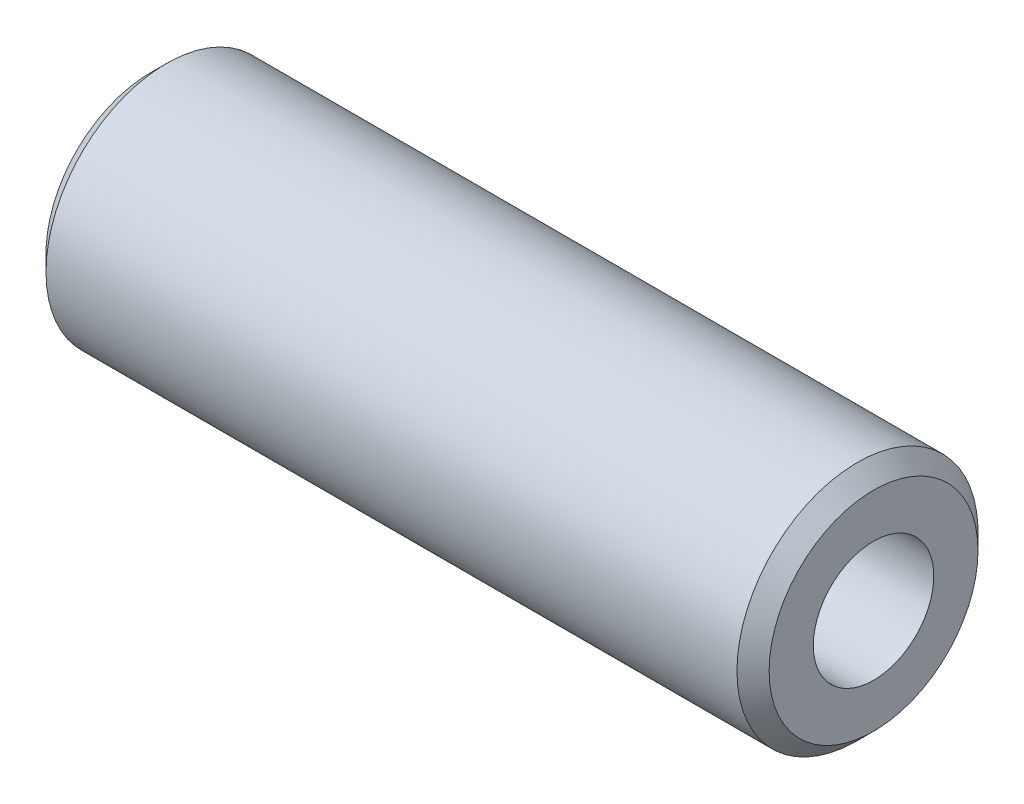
ISO-10303-21;
HEADER;
FILE_DESCRIPTION(('STEP AP214'),'2;1');
FILE_NAME('part.step','',(''),(''),'','','');
FILE_SCHEMA(('AUTOMOTIVE_DESIGN { 1 0 10303 214 1 1 1 1 }'));
ENDSEC;
DATA;
#1=APPLICATION_CONTEXT('core data for automotive mechanical design processes');
#2=APPLICATION_PROTOCOL_DEFINITION('international standard','automotive_design',2000,#1);
#3=PRODUCT_CONTEXT('',#1,'mechanical');
#4=PRODUCT('Part','Part','',(#3));
#5=PRODUCT_RELATED_PRODUCT_CATEGORY('part','',(#4));
#6=PRODUCT_DEFINITION_FORMATION('','',#4);
#7=PRODUCT_DEFINITION_CONTEXT('part definition',#1,'design');
#8=PRODUCT_DEFINITION('design','',#6,#7);
#9=PRODUCT_DEFINITION_SHAPE('','',#8);
#10=(LENGTH_UNIT() NAMED_UNIT(*) SI_UNIT(.MILLI.,.METRE.));
#11=(NAMED_UNIT(*) PLANE_ANGLE_UNIT() SI_UNIT($,.RADIAN.));
#12=(NAMED_UNIT(*) SI_UNIT($,.STERADIAN.) SOLID_ANGLE_UNIT());
#13=UNCERTAINTY_MEASURE_WITH_UNIT(LENGTH_MEASURE(1.E-05),#10,'distance_accuracy_value','');
#14=(GEOMETRIC_REPRESENTATION_CONTEXT(3) GLOBAL_UNCERTAINTY_ASSIGNED_CONTEXT((#13)) GLOBAL_UNIT_ASSIGNED_CONTEXT((#10,
#11,#12)) REPRESENTATION_CONTEXT('',''));
#15=CARTESIAN_POINT('',(0.,0.,0.));
#16=DIRECTION('',(0.,0.,1.));
#17=DIRECTION('',(1.,0.,0.));
#18=AXIS2_PLACEMENT_3D('',#15,#16,#17);
#19=CARTESIAN_POINT('',(45.,0.,0.));
#20=DIRECTION('',(1.,0.,0.));
#21=DIRECTION('',(0.,0.,-1.));
#22=AXIS2_PLACEMENT_3D('',#19,#20,#21);
#23=PLANE('',#22);
#24=CARTESIAN_POINT('',(45.,0.,0.));
#25=DIRECTION('',(1.,0.,0.));
#26=DIRECTION('',(0.,0.,-1.));
#27=AXIS2_PLACEMENT_3D('',#24,#25,#26);
#28=CIRCLE('',#27,13.0000000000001);
#29=CARTESIAN_POINT('',(45.,0.,-13.0000000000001));
#30=VERTEX_POINT('',#29);
#31=EDGE_CURVE('E10',#30,#30,#28,.T.);
#32=ORIENTED_EDGE('',*,*,#31,.T.);
#33=EDGE_LOOP('',(#32));
#34=FACE_BOUND('',#33,.T.);
#35=CARTESIAN_POINT('',(45.,0.,0.));
#36=DIRECTION('',(1.,0.,0.));
#37=DIRECTION('',(0.,0.,-1.));
#38=AXIS2_PLACEMENT_3D('',#35,#36,#37);
#39=CIRCLE('',#38,7.5);
#40=CARTESIAN_POINT('',(45.,0.,7.5));
#41=VERTEX_POINT('',#40);
#42=EDGE_CURVE('E59',#41,#41,#39,.T.);
#43=ORIENTED_EDGE('',*,*,#42,.F.);
#44=EDGE_LOOP('',(#43));
#45=FACE_BOUND('',#44,.T.);
#46=ADVANCED_FACE('F38',(#34,#45),#23,.T.);
#47=CARTESIAN_POINT('',(-45.,0.,0.));
#48=DIRECTION('',(1.,0.,0.));
#49=DIRECTION('',(0.,0.,-1.));
#50=AXIS2_PLACEMENT_3D('',#47,#48,#49);
#51=PLANE('',#50);
#52=CARTESIAN_POINT('',(-45.,0.,0.));
#53=DIRECTION('',(1.,0.,0.));
#54=DIRECTION('',(0.,0.,-1.));
#55=AXIS2_PLACEMENT_3D('',#52,#53,#54);
#56=CIRCLE('',#55,13.);
#57=CARTESIAN_POINT('',(-45.,0.,-13.));
#58=VERTEX_POINT('',#57);
#59=EDGE_CURVE('E46',#58,#58,#56,.F.);
#60=ORIENTED_EDGE('',*,*,#59,.T.);
#61=EDGE_LOOP('',(#60));
#62=FACE_BOUND('',#61,.T.);
#63=CARTESIAN_POINT('',(-45.,0.,0.));
#64=DIRECTION('',(1.,0.,0.));
#65=DIRECTION('',(0.,0.,-1.));
#66=AXIS2_PLACEMENT_3D('',#63,#64,#65);
#67=CIRCLE('',#66,7.5);
#68=CARTESIAN_POINT('',(-45.,0.,7.5));
#69=VERTEX_POINT('',#68);
#70=EDGE_CURVE('E60',#69,#69,#67,.T.);
#71=ORIENTED_EDGE('',*,*,#70,.T.);
#72=EDGE_LOOP('',(#71));
#73=FACE_BOUND('',#72,.T.);
#74=ADVANCED_FACE('F70',(#62,#73),#51,.F.);
#75=CARTESIAN_POINT('',(45.,0.,0.));
#76=DIRECTION('',(-1.,0.,0.));
#77=DIRECTION('',(0.,0.,1.));
#78=AXIS2_PLACEMENT_3D('',#75,#76,#77);
#79=CYLINDRICAL_SURFACE('',#78,15.);
#80=CARTESIAN_POINT('',(-43.,0.,0.));
#81=DIRECTION('',(1.,0.,0.));
#82=DIRECTION('',(0.,0.,-1.));
#83=AXIS2_PLACEMENT_3D('',#80,#81,#82);
#84=CIRCLE('',#83,15.);
#85=CARTESIAN_POINT('',(-43.,0.,15.));
#86=VERTEX_POINT('',#85);
#87=EDGE_CURVE('E50',#86,#86,#84,.T.);
#88=CARTESIAN_POINT('',(43.,0.,0.));
#89=DIRECTION('',(1.,0.,0.));
#90=DIRECTION('',(0.,0.,-1.));
#91=AXIS2_PLACEMENT_3D('',#88,#89,#90);
#92=CIRCLE('',#91,15.);
#93=CARTESIAN_POINT('',(43.,0.,15.));
#94=VERTEX_POINT('',#93);
#95=EDGE_CURVE('E54',#94,#94,#92,.F.);
#96=CARTESIAN_POINT('',(-43.,0.,15.));
#97=CARTESIAN_POINT('',(-42.1041666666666,0.,15.));
#98=CARTESIAN_POINT('',(-41.2083333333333,0.,15.));
#99=CARTESIAN_POINT('',(-39.4166666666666,0.,15.));
#100=CARTESIAN_POINT('',(-38.5208333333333,0.,15.));
#101=CARTESIAN_POINT('',(-36.7291666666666,0.,15.));
#102=CARTESIAN_POINT('',(-35.8333333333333,0.,15.));
#103=CARTESIAN_POINT('',(-34.0416666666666,0.,15.));
#104=CARTESIAN_POINT('',(-33.1458333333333,0.,15.));
#105=CARTESIAN_POINT('',(-31.3541666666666,0.,15.));
#106=CARTESIAN_POINT('',(-30.4583333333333,0.,15.));
#107=CARTESIAN_POINT('',(-28.6666666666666,0.,15.));
#108=CARTESIAN_POINT('',(-27.7708333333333,0.,15.));
#109=CARTESIAN_POINT('',(-25.9791666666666,0.,15.));
#110=CARTESIAN_POINT('',(-25.0833333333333,0.,15.));
#111=CARTESIAN_POINT('',(-23.2916666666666,0.,15.));
#112=CARTESIAN_POINT('',(-22.3958333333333,0.,15.));
#113=CARTESIAN_POINT('',(-20.6041666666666,0.,15.));
#114=CARTESIAN_POINT('',(-19.7083333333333,0.,15.));
#115=CARTESIAN_POINT('',(-17.9166666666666,0.,15.));
#116=CARTESIAN_POINT('',(-17.0208333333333,0.,15.));
#117=CARTESIAN_POINT('',(-15.2291666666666,0.,15.));
#118=CARTESIAN_POINT('',(-14.3333333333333,0.,15.));
#119=CARTESIAN_POINT('',(-12.5416666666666,0.,15.));
#120=CARTESIAN_POINT('',(-11.6458333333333,0.,15.));
#121=CARTESIAN_POINT('',(-9.85416666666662,0.,15.));
#122=CARTESIAN_POINT('',(-8.95833333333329,0.,15.));
#123=CARTESIAN_POINT('',(-7.16666666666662,0.,15.));
#124=CARTESIAN_POINT('',(-6.27083333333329,0.,15.));
#125=CARTESIAN_POINT('',(-4.47916666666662,0.,15.));
#126=CARTESIAN_POINT('',(-3.58333333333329,0.,15.));
#127=CARTESIAN_POINT('',(-1.79166666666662,0.,15.));
#128=CARTESIAN_POINT('',(-0.895833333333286,0.,15.));
#129=CARTESIAN_POINT('',(0.895833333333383,0.,15.));
#130=CARTESIAN_POINT('',(1.79166666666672,0.,15.));
#131=CARTESIAN_POINT('',(3.58333333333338,0.,15.));
#132=CARTESIAN_POINT('',(4.47916666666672,0.,15.));
#133=CARTESIAN_POINT('',(6.27083333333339,0.,15.));
#134=CARTESIAN_POINT('',(7.16666666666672,0.,15.));
#135=CARTESIAN_POINT('',(8.95833333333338,0.,15.));
#136=CARTESIAN_POINT('',(9.85416666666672,0.,15.));
#137=CARTESIAN_POINT('',(11.6458333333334,0.,15.));
#138=CARTESIAN_POINT('',(12.5416666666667,0.,15.));
#139=CARTESIAN_POINT('',(14.3333333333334,0.,15.));
#140=CARTESIAN_POINT('',(15.2291666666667,0.,15.));
#141=CARTESIAN_POINT('',(17.0208333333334,0.,15.));
#142=CARTESIAN_POINT('',(17.9166666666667,0.,15.));
#143=CARTESIAN_POINT('',(19.7083333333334,0.,15.));
#144=CARTESIAN_POINT('',(20.6041666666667,0.,15.));
#145=CARTESIAN_POINT('',(22.3958333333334,0.,15.));
#146=CARTESIAN_POINT('',(23.2916666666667,0.,15.));
#147=CARTESIAN_POINT('',(25.0833333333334,0.,15.));
#148=CARTESIAN_POINT('',(25.9791666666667,0.,15.));
#149=CARTESIAN_POINT('',(27.7708333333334,0.,15.));
#150=CARTESIAN_POINT('',(28.6666666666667,0.,15.));
#151=CARTESIAN_POINT('',(30.4583333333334,0.,15.));
#152=CARTESIAN_POINT('',(31.3541666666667,0.,15.));
#153=CARTESIAN_POINT('',(33.1458333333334,0.,15.));
#154=CARTESIAN_POINT('',(34.0416666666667,0.,15.));
#155=CARTESIAN_POINT('',(35.8333333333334,0.,15.));
#156=CARTESIAN_POINT('',(36.7291666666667,0.,15.));
#157=CARTESIAN_POINT('',(38.5208333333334,0.,15.));
#158=CARTESIAN_POINT('',(39.4166666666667,0.,15.));
#159=CARTESIAN_POINT('',(41.2083333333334,0.,15.));
#160=CARTESIAN_POINT('',(42.1041666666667,0.,15.));
#161=CARTESIAN_POINT('',(43.,0.,15.));
#162=B_SPLINE_CURVE_WITH_KNOTS('',3,(#96,#97,#98,#99,#100,#101,#102,#103,#104,#105,#106,#107,
#108,#109,#110,#111,#112,#113,#114,#115,#116,#117,#118,#119,#120,#121,#122,#123,#124,#125,#126,
#127,#128,#129,#130,#131,#132,#133,#134,#135,#136,#137,#138,#139,#140,#141,#142,#143,#144,#145,
#146,#147,#148,#149,#150,#151,#152,#153,#154,#155,#156,#157,#158,#159,#160,#161),.UNSPECIFIED.,
.F.,.F.,(4,2,2,2,2,2,2,2,2,2,2,2,2,2,2,2,2,2,2,2,2,2,2,2,2,2,2,2,2,2,2,2,4),(0.,2.6875,5.375,
8.0625,10.75,13.4375,16.125,18.8125,21.5,24.1875,26.875,29.5625,32.25,34.9375,37.625,40.3125,
43.,45.6875,48.375,51.0625,53.75,56.4375,59.125,61.8125,64.5,67.1875,69.875,72.5625,75.25,
77.9375,80.625,83.3125,86.),.UNSPECIFIED.);
#163=EDGE_CURVE('BSEAM75',#86,#94,#162,.T.);
#164=ORIENTED_EDGE('',*,*,#87,.T.);
#165=ORIENTED_EDGE('',*,*,#95,.T.);
#166=ORIENTED_EDGE('',*,*,#163,.T.);
#167=ORIENTED_EDGE('',*,*,#163,.F.);
#168=EDGE_LOOP('',(#164,#166,#165,#167));
#169=FACE_BOUND('',#168,.T.);
#170=ADVANCED_FACE('F75',(#169),#79,.T.);
#171=CARTESIAN_POINT('',(45.,0.,0.));
#172=DIRECTION('',(-1.,0.,0.));
#173=DIRECTION('',(0.,0.,1.));
#174=AXIS2_PLACEMENT_3D('',#171,#172,#173);
#175=CYLINDRICAL_SURFACE('',#174,7.5);
#176=CARTESIAN_POINT('',(45.,0.,7.5));
#177=CARTESIAN_POINT('',(44.0625,0.,7.5));
#178=CARTESIAN_POINT('',(43.125,0.,7.5));
#179=CARTESIAN_POINT('',(41.25,0.,7.5));
#180=CARTESIAN_POINT('',(40.3125,0.,7.5));
#181=CARTESIAN_POINT('',(38.4375,0.,7.5));
#182=CARTESIAN_POINT('',(37.5,0.,7.5));
#183=CARTESIAN_POINT('',(35.625,0.,7.5));
#184=CARTESIAN_POINT('',(34.6875,0.,7.5));
#185=CARTESIAN_POINT('',(32.8125,0.,7.5));
#186=CARTESIAN_POINT('',(31.875,0.,7.5));
#187=CARTESIAN_POINT('',(30.,0.,7.5));
#188=CARTESIAN_POINT('',(29.0625,0.,7.5));
#189=CARTESIAN_POINT('',(27.1875,0.,7.5));
#190=CARTESIAN_POINT('',(26.25,0.,7.5));
#191=CARTESIAN_POINT('',(24.375,0.,7.5));
#192=CARTESIAN_POINT('',(23.4375,0.,7.5));
#193=CARTESIAN_POINT('',(21.5625,0.,7.5));
#194=CARTESIAN_POINT('',(20.625,0.,7.5));
#195=CARTESIAN_POINT('',(18.75,0.,7.5));
#196=CARTESIAN_POINT('',(17.8125,0.,7.5));
#197=CARTESIAN_POINT('',(15.9375,0.,7.5));
#198=CARTESIAN_POINT('',(15.,0.,7.5));
#199=CARTESIAN_POINT('',(13.125,0.,7.5));
#200=CARTESIAN_POINT('',(12.1875,0.,7.5));
#201=CARTESIAN_POINT('',(10.3125,0.,7.5));
#202=CARTESIAN_POINT('',(9.37499999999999,0.,7.5));
#203=CARTESIAN_POINT('',(7.5,0.,7.5));
#204=CARTESIAN_POINT('',(6.5625,0.,7.5));
#205=CARTESIAN_POINT('',(4.6875,0.,7.5));
#206=CARTESIAN_POINT('',(3.75,0.,7.5));
#207=CARTESIAN_POINT('',(1.87499999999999,0.,7.5));
#208=CARTESIAN_POINT('',(0.937499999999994,0.,7.5));
#209=CARTESIAN_POINT('',(-0.937500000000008,0.,7.5));
#210=CARTESIAN_POINT('',(-1.87500000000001,0.,7.5));
#211=CARTESIAN_POINT('',(-3.75000000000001,0.,7.5));
#212=CARTESIAN_POINT('',(-4.68750000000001,0.,7.5));
#213=CARTESIAN_POINT('',(-6.56250000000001,0.,7.5));
#214=CARTESIAN_POINT('',(-7.50000000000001,0.,7.5));
#215=CARTESIAN_POINT('',(-9.37500000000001,0.,7.5));
#216=CARTESIAN_POINT('',(-10.3125,0.,7.5));
#217=CARTESIAN_POINT('',(-12.1875,0.,7.5));
#218=CARTESIAN_POINT('',(-13.125,0.,7.5));
#219=CARTESIAN_POINT('',(-15.,0.,7.5));
#220=CARTESIAN_POINT('',(-15.9375,0.,7.5));
#221=CARTESIAN_POINT('',(-17.8125,0.,7.5));
#222=CARTESIAN_POINT('',(-18.75,0.,7.5));
#223=CARTESIAN_POINT('',(-20.625,0.,7.5));
#224=CARTESIAN_POINT('',(-21.5625,0.,7.5));
#225=CARTESIAN_POINT('',(-23.4375,0.,7.5));
#226=CARTESIAN_POINT('',(-24.375,0.,7.5));
#227=CARTESIAN_POINT('',(-26.25,0.,7.5));
#228=CARTESIAN_POINT('',(-27.1875,0.,7.5));
#229=CARTESIAN_POINT('',(-29.0625,0.,7.5));
#230=CARTESIAN_POINT('',(-30.,0.,7.5));
#231=CARTESIAN_POINT('',(-31.875,0.,7.5));
#232=CARTESIAN_POINT('',(-32.8125,0.,7.5));
#233=CARTESIAN_POINT('',(-34.6875,0.,7.5));
#234=CARTESIAN_POINT('',(-35.625,0.,7.5));
#235=CARTESIAN_POINT('',(-37.5,0.,7.5));
#236=CARTESIAN_POINT('',(-38.4375,0.,7.5));
#237=CARTESIAN_POINT('',(-40.3125,0.,7.5));
#238=CARTESIAN_POINT('',(-41.25,0.,7.5));
#239=CARTESIAN_POINT('',(-43.125,0.,7.5));
#240=CARTESIAN_POINT('',(-44.0625,0.,7.5));
#241=CARTESIAN_POINT('',(-45.,0.,7.5));
#242=B_SPLINE_CURVE_WITH_KNOTS('',3,(#176,#177,#178,#179,#180,#181,#182,#183,#184,#185,#186,
#187,#188,#189,#190,#191,#192,#193,#194,#195,#196,#197,#198,#199,#200,#201,#202,#203,#204,#205,
#206,#207,#208,#209,#210,#211,#212,#213,#214,#215,#216,#217,#218,#219,#220,#221,#222,#223,#224,
#225,#226,#227,#228,#229,#230,#231,#232,#233,#234,#235,#236,#237,#238,#239,#240,#241),
.UNSPECIFIED.,.F.,.F.,(4,2,2,2,2,2,2,2,2,2,2,2,2,2,2,2,2,2,2,2,2,2,2,2,2,2,2,2,2,2,2,2,4),(0.,
2.8125,5.62500000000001,8.4375,11.25,14.0625,16.875,19.6875,22.5,25.3125,28.125,30.9375,33.75,
36.5625,39.375,42.1875,45.,47.8125,50.625,53.4375,56.25,59.0625,61.875,64.6875,67.5,70.3125,
73.125,75.9375,78.75,81.5625,84.375,87.1875,90.),.UNSPECIFIED.);
#243=EDGE_CURVE('BSEAM66',#41,#69,#242,.T.);
#244=ORIENTED_EDGE('',*,*,#42,.T.);
#245=ORIENTED_EDGE('',*,*,#70,.F.);
#246=ORIENTED_EDGE('',*,*,#243,.T.);
#247=ORIENTED_EDGE('',*,*,#243,.F.);
#248=EDGE_LOOP('',(#244,#246,#245,#247));
#249=FACE_BOUND('',#248,.T.);
#250=ADVANCED_FACE('F66',(#249),#175,.F.);
#251=CARTESIAN_POINT('',(-43.,0.,0.));
#252=DIRECTION('',(1.,0.,0.));
#253=DIRECTION('',(0.,0.,-1.));
#254=AXIS2_PLACEMENT_3D('',#251,#252,#253);
#255=CONICAL_SURFACE('',#254,15.,0.785398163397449);
#256=ORIENTED_EDGE('',*,*,#59,.F.);
#257=EDGE_LOOP('',(#256));
#258=FACE_BOUND('',#257,.T.);
#259=ORIENTED_EDGE('',*,*,#87,.F.);
#260=EDGE_LOOP('',(#259));
#261=FACE_BOUND('',#260,.T.);
#262=ADVANCED_FACE('F82',(#258,#261),#255,.T.);
#263=CARTESIAN_POINT('',(45.,0.,0.));
#264=DIRECTION('',(-1.,0.,0.));
#265=DIRECTION('',(0.,0.,1.));
#266=AXIS2_PLACEMENT_3D('',#263,#264,#265);
#267=CONICAL_SURFACE('',#266,13.0000000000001,0.785398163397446);
#268=ORIENTED_EDGE('',*,*,#95,.F.);
#269=EDGE_LOOP('',(#268));
#270=FACE_BOUND('',#269,.T.);
#271=ORIENTED_EDGE('',*,*,#31,.F.);
#272=EDGE_LOOP('',(#271));
#273=FACE_BOUND('',#272,.T.);
#274=ADVANCED_FACE('F41',(#270,#273),#267,.T.);
#275=CLOSED_SHELL('',(#46,#74,#170,#250,#262,#274));
#276=MANIFOLD_SOLID_BREP('B2',#275);
#277=ADVANCED_BREP_SHAPE_REPRESENTATION('',(#18,#276),#14);
#278=SHAPE_DEFINITION_REPRESENTATION(#9,#277);
ENDSEC;
END-ISO-10303-21;
